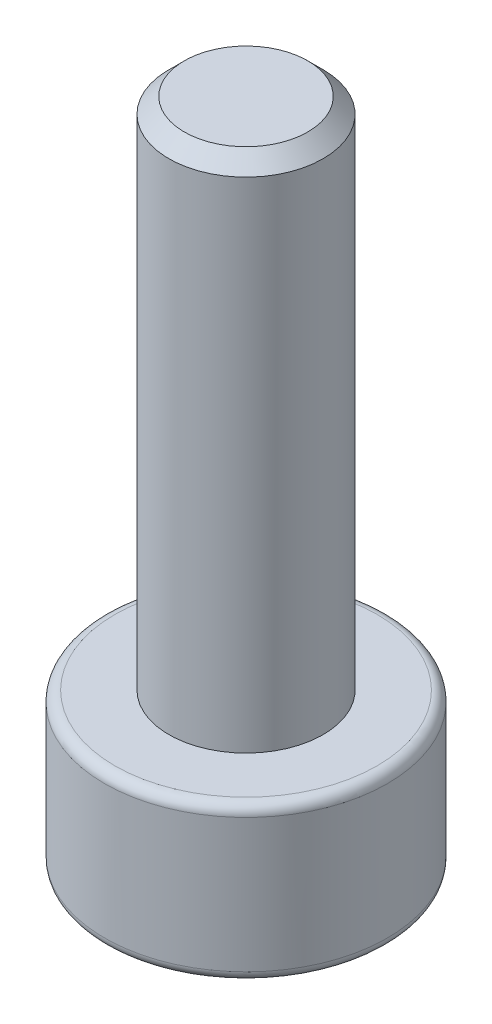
ISO-10303-21;
HEADER;
FILE_DESCRIPTION(('STEP AP214'),'2;1');
FILE_NAME('part.step','',(''),(''),'','','');
FILE_SCHEMA(('AUTOMOTIVE_DESIGN { 1 0 10303 214 1 1 1 1 }'));
ENDSEC;
DATA;
#1=APPLICATION_CONTEXT('core data for automotive mechanical design processes');
#2=APPLICATION_PROTOCOL_DEFINITION('international standard','automotive_design',2000,#1);
#3=PRODUCT_CONTEXT('',#1,'mechanical');
#4=PRODUCT('Part','Part','',(#3));
#5=PRODUCT_RELATED_PRODUCT_CATEGORY('part','',(#4));
#6=PRODUCT_DEFINITION_FORMATION('','',#4);
#7=PRODUCT_DEFINITION_CONTEXT('part definition',#1,'design');
#8=PRODUCT_DEFINITION('design','',#6,#7);
#9=PRODUCT_DEFINITION_SHAPE('','',#8);
#10=(LENGTH_UNIT() NAMED_UNIT(*) SI_UNIT(.MILLI.,.METRE.));
#11=(NAMED_UNIT(*) PLANE_ANGLE_UNIT() SI_UNIT($,.RADIAN.));
#12=(NAMED_UNIT(*) SI_UNIT($,.STERADIAN.) SOLID_ANGLE_UNIT());
#13=UNCERTAINTY_MEASURE_WITH_UNIT(LENGTH_MEASURE(1.E-05),#10,'distance_accuracy_value','');
#14=(GEOMETRIC_REPRESENTATION_CONTEXT(3) GLOBAL_UNCERTAINTY_ASSIGNED_CONTEXT((#13)) GLOBAL_UNIT_ASSIGNED_CONTEXT((#10,
#11,#12)) REPRESENTATION_CONTEXT('',''));
#15=CARTESIAN_POINT('',(0.,0.,0.));
#16=DIRECTION('',(0.,0.,1.));
#17=DIRECTION('',(1.,0.,0.));
#18=AXIS2_PLACEMENT_3D('',#15,#16,#17);
#19=CARTESIAN_POINT('',(-1.15470053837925,2.,0.));
#20=DIRECTION('',(-0.866025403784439,0.,-0.5));
#21=DIRECTION('',(-0.5,0.,0.866025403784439));
#22=AXIS2_PLACEMENT_3D('',#19,#20,#21);
#23=PLANE('',#22);
#24=DIRECTION('',(0.,1.,0.));
#25=VECTOR('',#24,1.);
#26=CARTESIAN_POINT('',(-0.577350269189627,2.,-1.));
#27=LINE('',#26,#25);
#28=CARTESIAN_POINT('',(-0.577350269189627,0.,-1.));
#29=VERTEX_POINT('',#28);
#30=CARTESIAN_POINT('',(-0.577350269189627,2.,-1.));
#31=VERTEX_POINT('',#30);
#32=EDGE_CURVE('E97',#29,#31,#27,.T.);
#33=ORIENTED_EDGE('',*,*,#32,.T.);
#34=DIRECTION('',(-0.5,0.,0.866025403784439));
#35=VECTOR('',#34,1.);
#36=CARTESIAN_POINT('',(-1.15470053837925,2.,0.));
#37=LINE('',#36,#35);
#38=CARTESIAN_POINT('',(-1.15470053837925,2.,0.));
#39=VERTEX_POINT('',#38);
#40=EDGE_CURVE('E86',#39,#31,#37,.F.);
#41=ORIENTED_EDGE('',*,*,#40,.F.);
#42=DIRECTION('',(0.,1.,0.));
#43=VECTOR('',#42,1.);
#44=CARTESIAN_POINT('',(-1.15470053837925,2.,0.));
#45=LINE('',#44,#43);
#46=CARTESIAN_POINT('',(-1.15470053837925,0.,0.));
#47=VERTEX_POINT('',#46);
#48=EDGE_CURVE('E106',#39,#47,#45,.F.);
#49=ORIENTED_EDGE('',*,*,#48,.T.);
#50=DIRECTION('',(-0.5,0.,0.866025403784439));
#51=VECTOR('',#50,1.);
#52=CARTESIAN_POINT('',(-1.15470053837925,0.,0.));
#53=LINE('',#52,#51);
#54=EDGE_CURVE('E81',#29,#47,#53,.T.);
#55=ORIENTED_EDGE('',*,*,#54,.F.);
#56=EDGE_LOOP('',(#33,#41,#49,#55));
#57=FACE_BOUND('',#56,.T.);
#58=ADVANCED_FACE('F17',(#57),#23,.F.);
#59=CARTESIAN_POINT('',(-0.577350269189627,2.,-1.));
#60=DIRECTION('',(0.,0.,-1.));
#61=DIRECTION('',(-1.,0.,0.));
#62=AXIS2_PLACEMENT_3D('',#59,#60,#61);
#63=PLANE('',#62);
#64=DIRECTION('',(0.,1.,0.));
#65=VECTOR('',#64,1.);
#66=CARTESIAN_POINT('',(0.577350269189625,2.,-1.));
#67=LINE('',#66,#65);
#68=CARTESIAN_POINT('',(0.577350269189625,0.,-1.));
#69=VERTEX_POINT('',#68);
#70=CARTESIAN_POINT('',(0.577350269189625,2.,-1.));
#71=VERTEX_POINT('',#70);
#72=EDGE_CURVE('E102',#69,#71,#67,.T.);
#73=ORIENTED_EDGE('',*,*,#72,.T.);
#74=DIRECTION('',(-1.,0.,0.));
#75=VECTOR('',#74,1.);
#76=CARTESIAN_POINT('',(-0.577350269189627,2.,-1.));
#77=LINE('',#76,#75);
#78=EDGE_CURVE('E90',#31,#71,#77,.F.);
#79=ORIENTED_EDGE('',*,*,#78,.F.);
#80=ORIENTED_EDGE('',*,*,#32,.F.);
#81=DIRECTION('',(-1.,0.,0.));
#82=VECTOR('',#81,1.);
#83=CARTESIAN_POINT('',(-0.577350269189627,0.,-1.));
#84=LINE('',#83,#82);
#85=EDGE_CURVE('E104',#69,#29,#84,.T.);
#86=ORIENTED_EDGE('',*,*,#85,.F.);
#87=EDGE_LOOP('',(#73,#79,#80,#86));
#88=FACE_BOUND('',#87,.T.);
#89=ADVANCED_FACE('F100',(#88),#63,.F.);
#90=CARTESIAN_POINT('',(-0.577350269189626,2.,1.));
#91=DIRECTION('',(-0.866025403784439,0.,0.5));
#92=DIRECTION('',(0.5,0.,0.866025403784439));
#93=AXIS2_PLACEMENT_3D('',#90,#91,#92);
#94=PLANE('',#93);
#95=ORIENTED_EDGE('',*,*,#48,.F.);
#96=DIRECTION('',(-0.5,0.,-0.866025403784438));
#97=VECTOR('',#96,1.);
#98=CARTESIAN_POINT('',(-0.577350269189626,2.,1.));
#99=LINE('',#98,#97);
#100=CARTESIAN_POINT('',(-0.577350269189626,2.,1.));
#101=VERTEX_POINT('',#100);
#102=EDGE_CURVE('E93',#101,#39,#99,.T.);
#103=ORIENTED_EDGE('',*,*,#102,.F.);
#104=DIRECTION('',(0.,1.,0.));
#105=VECTOR('',#104,1.);
#106=CARTESIAN_POINT('',(-0.577350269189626,2.,1.));
#107=LINE('',#106,#105);
#108=CARTESIAN_POINT('',(-0.577350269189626,0.,1.));
#109=VERTEX_POINT('',#108);
#110=EDGE_CURVE('E187',#101,#109,#107,.F.);
#111=ORIENTED_EDGE('',*,*,#110,.T.);
#112=DIRECTION('',(0.5,0.,0.866025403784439));
#113=VECTOR('',#112,1.);
#114=CARTESIAN_POINT('',(-0.577350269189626,0.,1.));
#115=LINE('',#114,#113);
#116=EDGE_CURVE('E199',#47,#109,#115,.T.);
#117=ORIENTED_EDGE('',*,*,#116,.F.);
#118=EDGE_LOOP('',(#95,#103,#111,#117));
#119=FACE_BOUND('',#118,.T.);
#120=ADVANCED_FACE('F202',(#119),#94,.F.);
#121=CARTESIAN_POINT('',(0.577350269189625,2.,-1.));
#122=DIRECTION('',(0.866025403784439,0.,-0.5));
#123=DIRECTION('',(-0.5,0.,-0.866025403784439));
#124=AXIS2_PLACEMENT_3D('',#121,#122,#123);
#125=PLANE('',#124);
#126=DIRECTION('',(0.,1.,0.));
#127=VECTOR('',#126,1.);
#128=CARTESIAN_POINT('',(1.15470053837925,2.,0.));
#129=LINE('',#128,#127);
#130=CARTESIAN_POINT('',(1.15470053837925,0.,0.));
#131=VERTEX_POINT('',#130);
#132=CARTESIAN_POINT('',(1.15470053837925,2.,0.));
#133=VERTEX_POINT('',#132);
#134=EDGE_CURVE('E183',#131,#133,#129,.T.);
#135=ORIENTED_EDGE('',*,*,#134,.T.);
#136=DIRECTION('',(0.5,0.,0.866025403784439));
#137=VECTOR('',#136,1.);
#138=CARTESIAN_POINT('',(0.577350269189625,2.,-1.));
#139=LINE('',#138,#137);
#140=EDGE_CURVE('E193',#71,#133,#139,.T.);
#141=ORIENTED_EDGE('',*,*,#140,.F.);
#142=ORIENTED_EDGE('',*,*,#72,.F.);
#143=DIRECTION('',(-0.5,0.,-0.866025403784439));
#144=VECTOR('',#143,1.);
#145=CARTESIAN_POINT('',(0.577350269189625,0.,-1.));
#146=LINE('',#145,#144);
#147=EDGE_CURVE('E195',#131,#69,#146,.T.);
#148=ORIENTED_EDGE('',*,*,#147,.F.);
#149=EDGE_LOOP('',(#135,#141,#142,#148));
#150=FACE_BOUND('',#149,.T.);
#151=ADVANCED_FACE('F210',(#150),#125,.F.);
#152=CARTESIAN_POINT('',(0.,2.,0.));
#153=DIRECTION('',(0.,-1.,0.));
#154=DIRECTION('',(0.,0.,-1.));
#155=AXIS2_PLACEMENT_3D('',#152,#153,#154);
#156=PLANE('',#155);
#157=ORIENTED_EDGE('',*,*,#40,.T.);
#158=ORIENTED_EDGE('',*,*,#78,.T.);
#159=ORIENTED_EDGE('',*,*,#140,.T.);
#160=DIRECTION('',(0.5,0.,-0.866025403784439));
#161=VECTOR('',#160,1.);
#162=CARTESIAN_POINT('',(1.15470053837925,2.,0.));
#163=LINE('',#162,#161);
#164=CARTESIAN_POINT('',(0.577350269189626,2.,1.));
#165=VERTEX_POINT('',#164);
#166=EDGE_CURVE('E181',#133,#165,#163,.F.);
#167=ORIENTED_EDGE('',*,*,#166,.T.);
#168=DIRECTION('',(1.,0.,0.));
#169=VECTOR('',#168,1.);
#170=CARTESIAN_POINT('',(0.577350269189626,2.,1.));
#171=LINE('',#170,#169);
#172=EDGE_CURVE('E190',#165,#101,#171,.F.);
#173=ORIENTED_EDGE('',*,*,#172,.T.);
#174=ORIENTED_EDGE('',*,*,#102,.T.);
#175=EDGE_LOOP('',(#157,#158,#159,#167,#173,#174));
#176=FACE_BOUND('',#175,.T.);
#177=ADVANCED_FACE('F87',(#176),#156,.T.);
#178=CARTESIAN_POINT('',(0.577350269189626,2.,1.));
#179=DIRECTION('',(0.,0.,1.));
#180=DIRECTION('',(1.,0.,0.));
#181=AXIS2_PLACEMENT_3D('',#178,#179,#180);
#182=PLANE('',#181);
#183=ORIENTED_EDGE('',*,*,#110,.F.);
#184=ORIENTED_EDGE('',*,*,#172,.F.);
#185=DIRECTION('',(0.,1.,0.));
#186=VECTOR('',#185,1.);
#187=CARTESIAN_POINT('',(0.577350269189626,2.,1.));
#188=LINE('',#187,#186);
#189=CARTESIAN_POINT('',(0.577350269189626,0.,1.));
#190=VERTEX_POINT('',#189);
#191=EDGE_CURVE('E172',#165,#190,#188,.F.);
#192=ORIENTED_EDGE('',*,*,#191,.T.);
#193=DIRECTION('',(1.,0.,0.));
#194=VECTOR('',#193,1.);
#195=CARTESIAN_POINT('',(0.577350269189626,0.,1.));
#196=LINE('',#195,#194);
#197=EDGE_CURVE('E185',#109,#190,#196,.T.);
#198=ORIENTED_EDGE('',*,*,#197,.F.);
#199=EDGE_LOOP('',(#183,#184,#192,#198));
#200=FACE_BOUND('',#199,.T.);
#201=ADVANCED_FACE('F217',(#200),#182,.F.);
#202=CARTESIAN_POINT('',(1.15470053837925,2.,0.));
#203=DIRECTION('',(0.866025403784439,0.,0.5));
#204=DIRECTION('',(0.5,0.,-0.866025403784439));
#205=AXIS2_PLACEMENT_3D('',#202,#203,#204);
#206=PLANE('',#205);
#207=ORIENTED_EDGE('',*,*,#191,.F.);
#208=ORIENTED_EDGE('',*,*,#166,.F.);
#209=ORIENTED_EDGE('',*,*,#134,.F.);
#210=DIRECTION('',(-0.5,0.,0.866025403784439));
#211=VECTOR('',#210,1.);
#212=CARTESIAN_POINT('',(1.15470053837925,0.,0.));
#213=LINE('',#212,#211);
#214=EDGE_CURVE('E180',#131,#190,#213,.T.);
#215=ORIENTED_EDGE('',*,*,#214,.T.);
#216=EDGE_LOOP('',(#207,#208,#209,#215));
#217=FACE_BOUND('',#216,.T.);
#218=ADVANCED_FACE('F215',(#217),#206,.F.);
#219=CARTESIAN_POINT('',(0.,0.,0.));
#220=DIRECTION('',(0.,1.,0.));
#221=DIRECTION('',(0.,0.,1.));
#222=AXIS2_PLACEMENT_3D('',#219,#220,#221);
#223=PLANE('',#222);
#224=CARTESIAN_POINT('',(0.,0.,0.));
#225=DIRECTION('',(0.,1.,0.));
#226=DIRECTION('',(0.,0.,1.));
#227=AXIS2_PLACEMENT_3D('',#224,#225,#226);
#228=CIRCLE('',#227,2.55);
#229=CARTESIAN_POINT('',(0.,0.,2.55));
#230=VERTEX_POINT('',#229);
#231=CARTESIAN_POINT('',(0.,0.,-2.55));
#232=VERTEX_POINT('',#231);
#233=EDGE_CURVE('E271',#230,#232,#228,.T.);
#234=ORIENTED_EDGE('',*,*,#233,.F.);
#235=CARTESIAN_POINT('',(0.,0.,0.));
#236=DIRECTION('',(0.,1.,0.));
#237=DIRECTION('',(0.,0.,-1.));
#238=AXIS2_PLACEMENT_3D('',#235,#236,#237);
#239=CIRCLE('',#238,2.55);
#240=EDGE_CURVE('E270',#232,#230,#239,.T.);
#241=ORIENTED_EDGE('',*,*,#240,.F.);
#242=EDGE_LOOP('',(#234,#241));
#243=FACE_BOUND('',#242,.T.);
#244=ORIENTED_EDGE('',*,*,#147,.T.);
#245=ORIENTED_EDGE('',*,*,#85,.T.);
#246=ORIENTED_EDGE('',*,*,#54,.T.);
#247=ORIENTED_EDGE('',*,*,#116,.T.);
#248=ORIENTED_EDGE('',*,*,#197,.T.);
#249=ORIENTED_EDGE('',*,*,#214,.F.);
#250=EDGE_LOOP('',(#244,#245,#246,#247,#248,#249));
#251=FACE_BOUND('',#250,.T.);
#252=ADVANCED_FACE('F160',(#243,#251),#223,.F.);
#253=CARTESIAN_POINT('',(0.,0.2,0.));
#254=DIRECTION('',(0.,1.,0.));
#255=DIRECTION('',(0.,0.,1.));
#256=AXIS2_PLACEMENT_3D('',#253,#254,#255);
#257=TOROIDAL_SURFACE('',#256,2.55,0.2);
#258=ORIENTED_EDGE('',*,*,#233,.T.);
#259=ORIENTED_EDGE('',*,*,#240,.T.);
#260=EDGE_LOOP('',(#258,#259));
#261=FACE_BOUND('',#260,.T.);
#262=CARTESIAN_POINT('',(0.,0.2,0.));
#263=DIRECTION('',(0.,-1.,0.));
#264=DIRECTION('',(0.,0.,-1.));
#265=AXIS2_PLACEMENT_3D('',#262,#263,#264);
#266=CIRCLE('',#265,2.75);
#267=CARTESIAN_POINT('',(0.,0.2,-2.75));
#268=VERTEX_POINT('',#267);
#269=EDGE_CURVE('E151',#268,#268,#266,.F.);
#270=ORIENTED_EDGE('',*,*,#269,.F.);
#271=EDGE_LOOP('',(#270));
#272=FACE_BOUND('',#271,.T.);
#273=ADVANCED_FACE('F155',(#261,#272),#257,.T.);
#274=CARTESIAN_POINT('',(0.,3.,0.));
#275=DIRECTION('',(0.,-1.,0.));
#276=DIRECTION('',(0.,0.,-1.));
#277=AXIS2_PLACEMENT_3D('',#274,#275,#276);
#278=CYLINDRICAL_SURFACE('',#277,2.75);
#279=CARTESIAN_POINT('',(0.,2.8,0.));
#280=DIRECTION('',(0.,1.,0.));
#281=DIRECTION('',(0.,0.,1.));
#282=AXIS2_PLACEMENT_3D('',#279,#280,#281);
#283=CIRCLE('',#282,2.75);
#284=CARTESIAN_POINT('',(0.,2.8,2.75));
#285=VERTEX_POINT('',#284);
#286=EDGE_CURVE('E115',#285,#285,#283,.T.);
#287=ORIENTED_EDGE('',*,*,#286,.F.);
#288=EDGE_LOOP('',(#287));
#289=FACE_BOUND('',#288,.T.);
#290=ORIENTED_EDGE('',*,*,#269,.T.);
#291=EDGE_LOOP('',(#290));
#292=FACE_BOUND('',#291,.T.);
#293=ADVANCED_FACE('F159',(#289,#292),#278,.T.);
#294=CARTESIAN_POINT('',(0.,13.,0.));
#295=DIRECTION('',(0.,1.,0.));
#296=DIRECTION('',(0.,0.,1.));
#297=AXIS2_PLACEMENT_3D('',#294,#295,#296);
#298=PLANE('',#297);
#299=CARTESIAN_POINT('',(0.,13.0000000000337,0.));
#300=DIRECTION('',(0.,-1.,0.));
#301=DIRECTION('',(1.,0.,0.));
#302=AXIS2_PLACEMENT_3D('',#299,#300,#301);
#303=CIRCLE('',#302,1.19999999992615);
#304=CARTESIAN_POINT('',(1.19999999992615,13.0000000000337,0.));
#305=VERTEX_POINT('',#304);
#306=EDGE_CURVE('E111',#305,#305,#303,.T.);
#307=ORIENTED_EDGE('',*,*,#306,.F.);
#308=EDGE_LOOP('',(#307));
#309=FACE_BOUND('',#308,.T.);
#310=ADVANCED_FACE('F132',(#309),#298,.T.);
#311=CARTESIAN_POINT('',(0.,2.8,0.));
#312=DIRECTION('',(0.,1.,0.));
#313=DIRECTION('',(0.,0.,1.));
#314=AXIS2_PLACEMENT_3D('',#311,#312,#313);
#315=TOROIDAL_SURFACE('',#314,2.55,0.2);
#316=ORIENTED_EDGE('',*,*,#286,.T.);
#317=EDGE_LOOP('',(#316));
#318=FACE_BOUND('',#317,.T.);
#319=CARTESIAN_POINT('',(0.,3.,0.));
#320=DIRECTION('',(0.,-1.,0.));
#321=DIRECTION('',(0.,0.,1.));
#322=AXIS2_PLACEMENT_3D('',#319,#320,#321);
#323=CIRCLE('',#322,2.55);
#324=CARTESIAN_POINT('',(0.,3.,-2.55));
#325=VERTEX_POINT('',#324);
#326=CARTESIAN_POINT('',(0.,3.,2.55));
#327=VERTEX_POINT('',#326);
#328=EDGE_CURVE('E36',#325,#327,#323,.F.);
#329=ORIENTED_EDGE('',*,*,#328,.F.);
#330=CARTESIAN_POINT('',(0.,3.,0.));
#331=DIRECTION('',(0.,-1.,0.));
#332=DIRECTION('',(0.,0.,-1.));
#333=AXIS2_PLACEMENT_3D('',#330,#331,#332);
#334=CIRCLE('',#333,2.55);
#335=EDGE_CURVE('E114',#327,#325,#334,.F.);
#336=ORIENTED_EDGE('',*,*,#335,.F.);
#337=EDGE_LOOP('',(#329,#336));
#338=FACE_BOUND('',#337,.T.);
#339=ADVANCED_FACE('F120',(#318,#338),#315,.T.);
#340=CARTESIAN_POINT('',(0.,12.6999999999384,0.));
#341=DIRECTION('',(0.,-1.,0.));
#342=DIRECTION('',(1.,0.,0.));
#343=AXIS2_PLACEMENT_3D('',#340,#341,#342);
#344=CONICAL_SURFACE('',#343,1.49999999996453,0.785398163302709);
#345=CARTESIAN_POINT('',(0.,12.7,0.));
#346=DIRECTION('',(0.,-1.,0.));
#347=DIRECTION('',(0.,0.,-1.));
#348=AXIS2_PLACEMENT_3D('',#345,#346,#347);
#349=CIRCLE('',#348,1.5);
#350=CARTESIAN_POINT('',(0.,12.7,-1.5));
#351=VERTEX_POINT('',#350);
#352=EDGE_CURVE('E28',#351,#351,#349,.T.);
#353=ORIENTED_EDGE('',*,*,#352,.F.);
#354=EDGE_LOOP('',(#353));
#355=FACE_BOUND('',#354,.T.);
#356=ORIENTED_EDGE('',*,*,#306,.T.);
#357=EDGE_LOOP('',(#356));
#358=FACE_BOUND('',#357,.T.);
#359=ADVANCED_FACE('F131',(#355,#358),#344,.T.);
#360=CARTESIAN_POINT('',(0.,3.,0.));
#361=DIRECTION('',(0.,1.,0.));
#362=DIRECTION('',(0.,0.,1.));
#363=AXIS2_PLACEMENT_3D('',#360,#361,#362);
#364=PLANE('',#363);
#365=CARTESIAN_POINT('',(0.,3.,0.));
#366=DIRECTION('',(0.,-1.,0.));
#367=DIRECTION('',(0.,0.,-1.));
#368=AXIS2_PLACEMENT_3D('',#365,#366,#367);
#369=CIRCLE('',#368,1.5);
#370=CARTESIAN_POINT('',(0.,3.,-1.5));
#371=VERTEX_POINT('',#370);
#372=EDGE_CURVE('E11',#371,#371,#369,.F.);
#373=ORIENTED_EDGE('',*,*,#372,.F.);
#374=EDGE_LOOP('',(#373));
#375=FACE_BOUND('',#374,.T.);
#376=ORIENTED_EDGE('',*,*,#335,.T.);
#377=ORIENTED_EDGE('',*,*,#328,.T.);
#378=EDGE_LOOP('',(#376,#377));
#379=FACE_BOUND('',#378,.T.);
#380=ADVANCED_FACE('F228',(#375,#379),#364,.T.);
#381=CARTESIAN_POINT('',(0.,13.,0.));
#382=DIRECTION('',(0.,-1.,0.));
#383=DIRECTION('',(0.,0.,-1.));
#384=AXIS2_PLACEMENT_3D('',#381,#382,#383);
#385=CYLINDRICAL_SURFACE('',#384,1.5);
#386=ORIENTED_EDGE('',*,*,#372,.T.);
#387=EDGE_LOOP('',(#386));
#388=FACE_BOUND('',#387,.T.);
#389=ORIENTED_EDGE('',*,*,#352,.T.);
#390=EDGE_LOOP('',(#389));
#391=FACE_BOUND('',#390,.T.);
#392=ADVANCED_FACE('F226',(#388,#391),#385,.T.);
#393=CLOSED_SHELL('',(#58,#89,#120,#151,#177,#201,#218,#252,#273,#293,#310,#339,#359,#380,#392));
#394=MANIFOLD_SOLID_BREP('B1',#393);
#395=ADVANCED_BREP_SHAPE_REPRESENTATION('',(#18,#394),#14);
#396=SHAPE_DEFINITION_REPRESENTATION(#9,#395);
ENDSEC;
END-ISO-10303-21;
